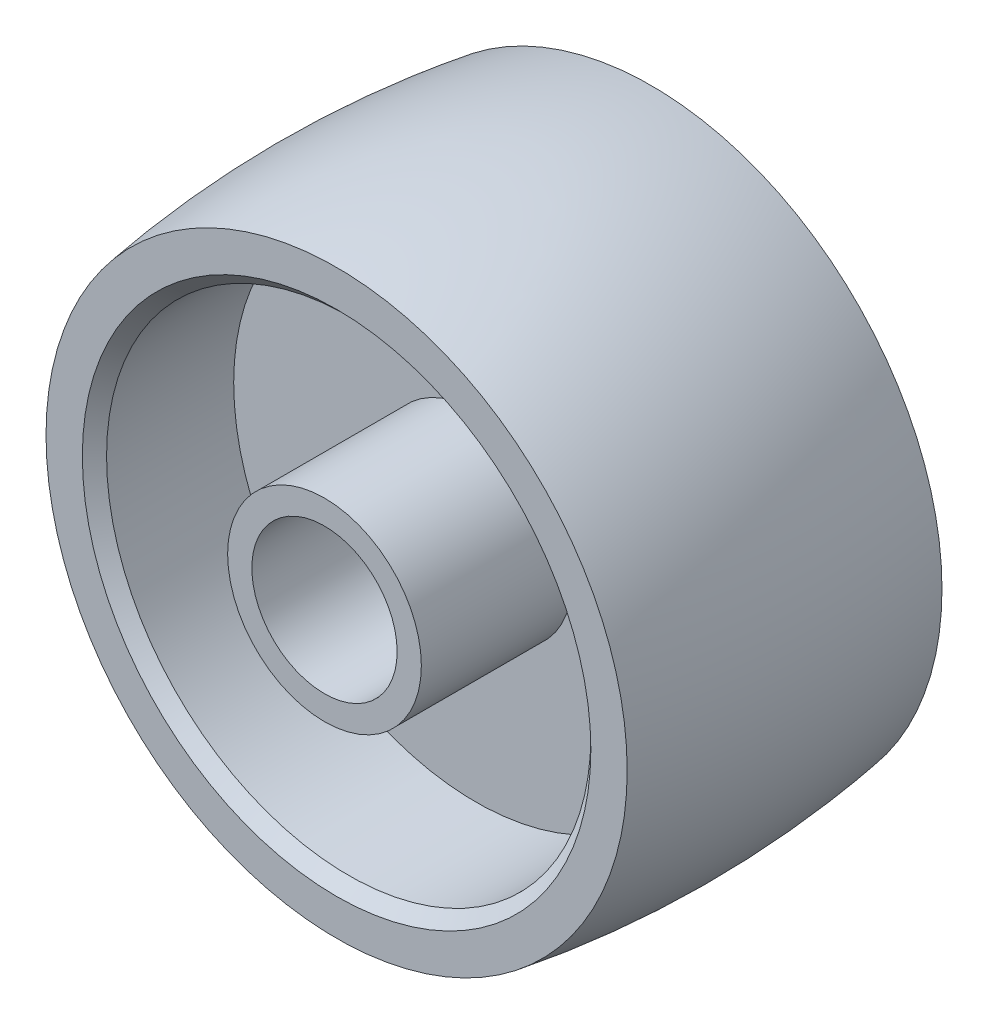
ISO-10303-21;
HEADER;
FILE_DESCRIPTION(('STEP AP214'),'2;1');
FILE_NAME('part.step','',(''),(''),'','','');
FILE_SCHEMA(('AUTOMOTIVE_DESIGN { 1 0 10303 214 1 1 1 1 }'));
ENDSEC;
DATA;
#1=APPLICATION_CONTEXT('core data for automotive mechanical design processes');
#2=APPLICATION_PROTOCOL_DEFINITION('international standard','automotive_design',2000,#1);
#3=PRODUCT_CONTEXT('',#1,'mechanical');
#4=PRODUCT('Part','Part','',(#3));
#5=PRODUCT_RELATED_PRODUCT_CATEGORY('part','',(#4));
#6=PRODUCT_DEFINITION_FORMATION('','',#4);
#7=PRODUCT_DEFINITION_CONTEXT('part definition',#1,'design');
#8=PRODUCT_DEFINITION('design','',#6,#7);
#9=PRODUCT_DEFINITION_SHAPE('','',#8);
#10=(LENGTH_UNIT() NAMED_UNIT(*) SI_UNIT(.MILLI.,.METRE.));
#11=(NAMED_UNIT(*) PLANE_ANGLE_UNIT() SI_UNIT($,.RADIAN.));
#12=(NAMED_UNIT(*) SI_UNIT($,.STERADIAN.) SOLID_ANGLE_UNIT());
#13=UNCERTAINTY_MEASURE_WITH_UNIT(LENGTH_MEASURE(1.E-05),#10,'distance_accuracy_value','');
#14=(GEOMETRIC_REPRESENTATION_CONTEXT(3) GLOBAL_UNCERTAINTY_ASSIGNED_CONTEXT((#13)) GLOBAL_UNIT_ASSIGNED_CONTEXT((#10,
#11,#12)) REPRESENTATION_CONTEXT('',''));
#15=CARTESIAN_POINT('',(0.,0.,0.));
#16=DIRECTION('',(0.,0.,1.));
#17=DIRECTION('',(1.,0.,0.));
#18=AXIS2_PLACEMENT_3D('',#15,#16,#17);
#19=CARTESIAN_POINT('',(0.,0.,6.5));
#20=DIRECTION('',(0.,0.,1.));
#21=DIRECTION('',(1.,0.,0.));
#22=AXIS2_PLACEMENT_3D('',#19,#20,#21);
#23=CONICAL_SURFACE('',#22,10.5,0.785398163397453);
#24=CARTESIAN_POINT('',(0.,0.,6.));
#25=DIRECTION('',(0.,0.,1.));
#26=DIRECTION('',(1.,0.,0.));
#27=AXIS2_PLACEMENT_3D('',#24,#25,#26);
#28=CIRCLE('',#27,10.);
#29=CARTESIAN_POINT('',(10.,0.,6.));
#30=VERTEX_POINT('',#29);
#31=EDGE_CURVE('E10',#30,#30,#28,.T.);
#32=ORIENTED_EDGE('',*,*,#31,.F.);
#33=EDGE_LOOP('',(#32));
#34=FACE_BOUND('',#33,.T.);
#35=CARTESIAN_POINT('',(0.,0.,6.5));
#36=DIRECTION('',(0.,0.,1.));
#37=DIRECTION('',(1.,0.,0.));
#38=AXIS2_PLACEMENT_3D('',#35,#36,#37);
#39=CIRCLE('',#38,10.5);
#40=CARTESIAN_POINT('',(10.5,0.,6.5));
#41=VERTEX_POINT('',#40);
#42=EDGE_CURVE('E79',#41,#41,#39,.T.);
#43=ORIENTED_EDGE('',*,*,#42,.T.);
#44=EDGE_LOOP('',(#43));
#45=FACE_BOUND('',#44,.T.);
#46=ADVANCED_FACE('F33',(#34,#45),#23,.F.);
#47=CARTESIAN_POINT('',(0.,0.,4.71471149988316));
#48=DIRECTION('',(0.,0.,1.));
#49=DIRECTION('',(1.,0.,0.));
#50=AXIS2_PLACEMENT_3D('',#47,#48,#49);
#51=CYLINDRICAL_SURFACE('',#50,10.);
#52=CARTESIAN_POINT('',(0.,0.,0.750000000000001));
#53=DIRECTION('',(0.,0.,1.));
#54=DIRECTION('',(1.,0.,0.));
#55=AXIS2_PLACEMENT_3D('',#52,#53,#54);
#56=CIRCLE('',#55,10.);
#57=CARTESIAN_POINT('',(10.,0.,0.750000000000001));
#58=VERTEX_POINT('',#57);
#59=EDGE_CURVE('E39',#58,#58,#56,.T.);
#60=ORIENTED_EDGE('',*,*,#59,.F.);
#61=EDGE_LOOP('',(#60));
#62=FACE_BOUND('',#61,.T.);
#63=ORIENTED_EDGE('',*,*,#31,.T.);
#64=EDGE_LOOP('',(#63));
#65=FACE_BOUND('',#64,.T.);
#66=ADVANCED_FACE('F152',(#62,#65),#51,.F.);
#67=CARTESIAN_POINT('',(0.,4.,0.75));
#68=DIRECTION('',(0.,0.,-1.));
#69=DIRECTION('',(-1.,0.,0.));
#70=AXIS2_PLACEMENT_3D('',#67,#68,#69);
#71=PLANE('',#70);
#72=CARTESIAN_POINT('',(0.,0.,0.75));
#73=DIRECTION('',(0.,0.,1.));
#74=DIRECTION('',(1.,0.,0.));
#75=AXIS2_PLACEMENT_3D('',#72,#73,#74);
#76=CIRCLE('',#75,4.);
#77=CARTESIAN_POINT('',(4.,0.,0.75));
#78=VERTEX_POINT('',#77);
#79=EDGE_CURVE('E43',#78,#78,#76,.T.);
#80=ORIENTED_EDGE('',*,*,#79,.F.);
#81=EDGE_LOOP('',(#80));
#82=FACE_BOUND('',#81,.T.);
#83=ORIENTED_EDGE('',*,*,#59,.T.);
#84=EDGE_LOOP('',(#83));
#85=FACE_BOUND('',#84,.T.);
#86=ADVANCED_FACE('F147',(#82,#85),#71,.F.);
#87=CARTESIAN_POINT('',(0.,0.,4.71471149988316));
#88=DIRECTION('',(0.,0.,1.));
#89=DIRECTION('',(1.,0.,0.));
#90=AXIS2_PLACEMENT_3D('',#87,#88,#89);
#91=CYLINDRICAL_SURFACE('',#90,4.);
#92=CARTESIAN_POINT('',(0.,0.,7.));
#93=DIRECTION('',(0.,0.,1.));
#94=DIRECTION('',(1.,0.,0.));
#95=AXIS2_PLACEMENT_3D('',#92,#93,#94);
#96=CIRCLE('',#95,4.);
#97=CARTESIAN_POINT('',(4.,0.,7.));
#98=VERTEX_POINT('',#97);
#99=EDGE_CURVE('E47',#98,#98,#96,.T.);
#100=ORIENTED_EDGE('',*,*,#99,.F.);
#101=EDGE_LOOP('',(#100));
#102=FACE_BOUND('',#101,.T.);
#103=ORIENTED_EDGE('',*,*,#79,.T.);
#104=EDGE_LOOP('',(#103));
#105=FACE_BOUND('',#104,.T.);
#106=ADVANCED_FACE('F141',(#102,#105),#91,.T.);
#107=CARTESIAN_POINT('',(0.,3.,7.));
#108=DIRECTION('',(0.,0.,-1.));
#109=DIRECTION('',(-1.,0.,0.));
#110=AXIS2_PLACEMENT_3D('',#107,#108,#109);
#111=PLANE('',#110);
#112=CARTESIAN_POINT('',(0.,0.,7.));
#113=DIRECTION('',(0.,0.,1.));
#114=DIRECTION('',(1.,0.,0.));
#115=AXIS2_PLACEMENT_3D('',#112,#113,#114);
#116=CIRCLE('',#115,3.);
#117=CARTESIAN_POINT('',(3.,0.,7.));
#118=VERTEX_POINT('',#117);
#119=EDGE_CURVE('E52',#118,#118,#116,.T.);
#120=ORIENTED_EDGE('',*,*,#119,.F.);
#121=EDGE_LOOP('',(#120));
#122=FACE_BOUND('',#121,.T.);
#123=ORIENTED_EDGE('',*,*,#99,.T.);
#124=EDGE_LOOP('',(#123));
#125=FACE_BOUND('',#124,.T.);
#126=ADVANCED_FACE('F135',(#122,#125),#111,.F.);
#127=CARTESIAN_POINT('',(0.,0.,4.71471149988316));
#128=DIRECTION('',(0.,0.,1.));
#129=DIRECTION('',(1.,0.,0.));
#130=AXIS2_PLACEMENT_3D('',#127,#128,#129);
#131=CYLINDRICAL_SURFACE('',#130,3.);
#132=CARTESIAN_POINT('',(0.,0.,-7.));
#133=DIRECTION('',(0.,0.,1.));
#134=DIRECTION('',(1.,0.,0.));
#135=AXIS2_PLACEMENT_3D('',#132,#133,#134);
#136=CIRCLE('',#135,3.);
#137=CARTESIAN_POINT('',(3.,0.,-7.));
#138=VERTEX_POINT('',#137);
#139=EDGE_CURVE('E55',#138,#138,#136,.T.);
#140=ORIENTED_EDGE('',*,*,#139,.F.);
#141=EDGE_LOOP('',(#140));
#142=FACE_BOUND('',#141,.T.);
#143=ORIENTED_EDGE('',*,*,#119,.T.);
#144=EDGE_LOOP('',(#143));
#145=FACE_BOUND('',#144,.T.);
#146=ADVANCED_FACE('F129',(#142,#145),#131,.F.);
#147=CARTESIAN_POINT('',(0.,3.,-7.));
#148=DIRECTION('',(0.,0.,1.));
#149=DIRECTION('',(1.,0.,0.));
#150=AXIS2_PLACEMENT_3D('',#147,#148,#149);
#151=PLANE('',#150);
#152=CARTESIAN_POINT('',(0.,0.,-7.));
#153=DIRECTION('',(0.,0.,1.));
#154=DIRECTION('',(1.,0.,0.));
#155=AXIS2_PLACEMENT_3D('',#152,#153,#154);
#156=CIRCLE('',#155,4.);
#157=CARTESIAN_POINT('',(4.,0.,-7.));
#158=VERTEX_POINT('',#157);
#159=EDGE_CURVE('E58',#158,#158,#156,.T.);
#160=ORIENTED_EDGE('',*,*,#159,.F.);
#161=EDGE_LOOP('',(#160));
#162=FACE_BOUND('',#161,.T.);
#163=ORIENTED_EDGE('',*,*,#139,.T.);
#164=EDGE_LOOP('',(#163));
#165=FACE_BOUND('',#164,.T.);
#166=ADVANCED_FACE('F123',(#162,#165),#151,.F.);
#167=CARTESIAN_POINT('',(0.,0.,4.71471149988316));
#168=DIRECTION('',(0.,0.,1.));
#169=DIRECTION('',(1.,0.,0.));
#170=AXIS2_PLACEMENT_3D('',#167,#168,#169);
#171=CYLINDRICAL_SURFACE('',#170,4.);
#172=CARTESIAN_POINT('',(0.,0.,-0.75));
#173=DIRECTION('',(0.,0.,1.));
#174=DIRECTION('',(1.,0.,0.));
#175=AXIS2_PLACEMENT_3D('',#172,#173,#174);
#176=CIRCLE('',#175,4.);
#177=CARTESIAN_POINT('',(4.,0.,-0.75));
#178=VERTEX_POINT('',#177);
#179=EDGE_CURVE('E61',#178,#178,#176,.T.);
#180=ORIENTED_EDGE('',*,*,#179,.F.);
#181=EDGE_LOOP('',(#180));
#182=FACE_BOUND('',#181,.T.);
#183=ORIENTED_EDGE('',*,*,#159,.T.);
#184=EDGE_LOOP('',(#183));
#185=FACE_BOUND('',#184,.T.);
#186=ADVANCED_FACE('F117',(#182,#185),#171,.T.);
#187=CARTESIAN_POINT('',(0.,4.,-0.75));
#188=DIRECTION('',(0.,0.,1.));
#189=DIRECTION('',(1.,0.,0.));
#190=AXIS2_PLACEMENT_3D('',#187,#188,#189);
#191=PLANE('',#190);
#192=CARTESIAN_POINT('',(0.,0.,-0.750000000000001));
#193=DIRECTION('',(0.,0.,1.));
#194=DIRECTION('',(1.,0.,0.));
#195=AXIS2_PLACEMENT_3D('',#192,#193,#194);
#196=CIRCLE('',#195,10.);
#197=CARTESIAN_POINT('',(10.,0.,-0.750000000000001));
#198=VERTEX_POINT('',#197);
#199=EDGE_CURVE('E64',#198,#198,#196,.T.);
#200=ORIENTED_EDGE('',*,*,#199,.F.);
#201=EDGE_LOOP('',(#200));
#202=FACE_BOUND('',#201,.T.);
#203=ORIENTED_EDGE('',*,*,#179,.T.);
#204=EDGE_LOOP('',(#203));
#205=FACE_BOUND('',#204,.T.);
#206=ADVANCED_FACE('F111',(#202,#205),#191,.F.);
#207=CARTESIAN_POINT('',(0.,0.,4.71471149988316));
#208=DIRECTION('',(0.,0.,1.));
#209=DIRECTION('',(1.,0.,0.));
#210=AXIS2_PLACEMENT_3D('',#207,#208,#209);
#211=CYLINDRICAL_SURFACE('',#210,10.);
#212=CARTESIAN_POINT('',(0.,0.,-6.));
#213=DIRECTION('',(0.,0.,1.));
#214=DIRECTION('',(1.,0.,0.));
#215=AXIS2_PLACEMENT_3D('',#212,#213,#214);
#216=CIRCLE('',#215,10.);
#217=CARTESIAN_POINT('',(10.,0.,-6.));
#218=VERTEX_POINT('',#217);
#219=EDGE_CURVE('E67',#218,#218,#216,.T.);
#220=ORIENTED_EDGE('',*,*,#219,.F.);
#221=EDGE_LOOP('',(#220));
#222=FACE_BOUND('',#221,.T.);
#223=ORIENTED_EDGE('',*,*,#199,.T.);
#224=EDGE_LOOP('',(#223));
#225=FACE_BOUND('',#224,.T.);
#226=ADVANCED_FACE('F105',(#222,#225),#211,.F.);
#227=CARTESIAN_POINT('',(0.,0.,-6.));
#228=DIRECTION('',(0.,0.,-1.));
#229=DIRECTION('',(-1.,0.,0.));
#230=AXIS2_PLACEMENT_3D('',#227,#228,#229);
#231=CONICAL_SURFACE('',#230,10.,0.785398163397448);
#232=CARTESIAN_POINT('',(0.,0.,-6.5));
#233=DIRECTION('',(0.,0.,1.));
#234=DIRECTION('',(1.,0.,0.));
#235=AXIS2_PLACEMENT_3D('',#232,#233,#234);
#236=CIRCLE('',#235,10.5);
#237=CARTESIAN_POINT('',(10.5,0.,-6.5));
#238=VERTEX_POINT('',#237);
#239=EDGE_CURVE('E70',#238,#238,#236,.T.);
#240=ORIENTED_EDGE('',*,*,#239,.F.);
#241=EDGE_LOOP('',(#240));
#242=FACE_BOUND('',#241,.T.);
#243=ORIENTED_EDGE('',*,*,#219,.T.);
#244=EDGE_LOOP('',(#243));
#245=FACE_BOUND('',#244,.T.);
#246=ADVANCED_FACE('F99',(#242,#245),#231,.F.);
#247=CARTESIAN_POINT('',(0.,10.5,-6.5));
#248=DIRECTION('',(0.,0.,1.));
#249=DIRECTION('',(1.,0.,0.));
#250=AXIS2_PLACEMENT_3D('',#247,#248,#249);
#251=PLANE('',#250);
#252=CARTESIAN_POINT('',(0.,0.,-6.5));
#253=DIRECTION('',(0.,0.,1.));
#254=DIRECTION('',(1.,0.,0.));
#255=AXIS2_PLACEMENT_3D('',#252,#253,#254);
#256=CIRCLE('',#255,12.);
#257=CARTESIAN_POINT('',(12.,0.,-6.5));
#258=VERTEX_POINT('',#257);
#259=EDGE_CURVE('E73',#258,#258,#256,.T.);
#260=ORIENTED_EDGE('',*,*,#259,.F.);
#261=EDGE_LOOP('',(#260));
#262=FACE_BOUND('',#261,.T.);
#263=ORIENTED_EDGE('',*,*,#239,.T.);
#264=EDGE_LOOP('',(#263));
#265=FACE_BOUND('',#264,.T.);
#266=ADVANCED_FACE('F93',(#262,#265),#251,.F.);
#267=CARTESIAN_POINT('',(0.,0.,0.));
#268=DIRECTION('',(0.,0.,1.));
#269=DIRECTION('',(1.,0.,0.));
#270=AXIS2_PLACEMENT_3D('',#267,#268,#269);
#271=DEGENERATE_TOROIDAL_SURFACE('',#270,30.0000000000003,42.5000000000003,.F.);
#272=CARTESIAN_POINT('',(0.,0.,6.5));
#273=DIRECTION('',(0.,0.,1.));
#274=DIRECTION('',(1.,0.,0.));
#275=AXIS2_PLACEMENT_3D('',#272,#273,#274);
#276=CIRCLE('',#275,12.);
#277=CARTESIAN_POINT('',(12.,0.,6.5));
#278=VERTEX_POINT('',#277);
#279=EDGE_CURVE('E76',#278,#278,#276,.T.);
#280=ORIENTED_EDGE('',*,*,#279,.F.);
#281=EDGE_LOOP('',(#280));
#282=FACE_BOUND('',#281,.T.);
#283=ORIENTED_EDGE('',*,*,#259,.T.);
#284=EDGE_LOOP('',(#283));
#285=FACE_BOUND('',#284,.T.);
#286=ADVANCED_FACE('F87',(#282,#285),#271,.F.);
#287=CARTESIAN_POINT('',(0.,10.5,6.5));
#288=DIRECTION('',(0.,0.,-1.));
#289=DIRECTION('',(-1.,0.,0.));
#290=AXIS2_PLACEMENT_3D('',#287,#288,#289);
#291=PLANE('',#290);
#292=ORIENTED_EDGE('',*,*,#42,.F.);
#293=EDGE_LOOP('',(#292));
#294=FACE_BOUND('',#293,.T.);
#295=ORIENTED_EDGE('',*,*,#279,.T.);
#296=EDGE_LOOP('',(#295));
#297=FACE_BOUND('',#296,.T.);
#298=ADVANCED_FACE('F84',(#294,#297),#291,.F.);
#299=CLOSED_SHELL('',(#46,#66,#86,#106,#126,#146,#166,#186,#206,#226,#246,#266,#286,#298));
#300=MANIFOLD_SOLID_BREP('B2',#299);
#301=ADVANCED_BREP_SHAPE_REPRESENTATION('',(#18,#300),#14);
#302=SHAPE_DEFINITION_REPRESENTATION(#9,#301);
ENDSEC;
END-ISO-10303-21;
